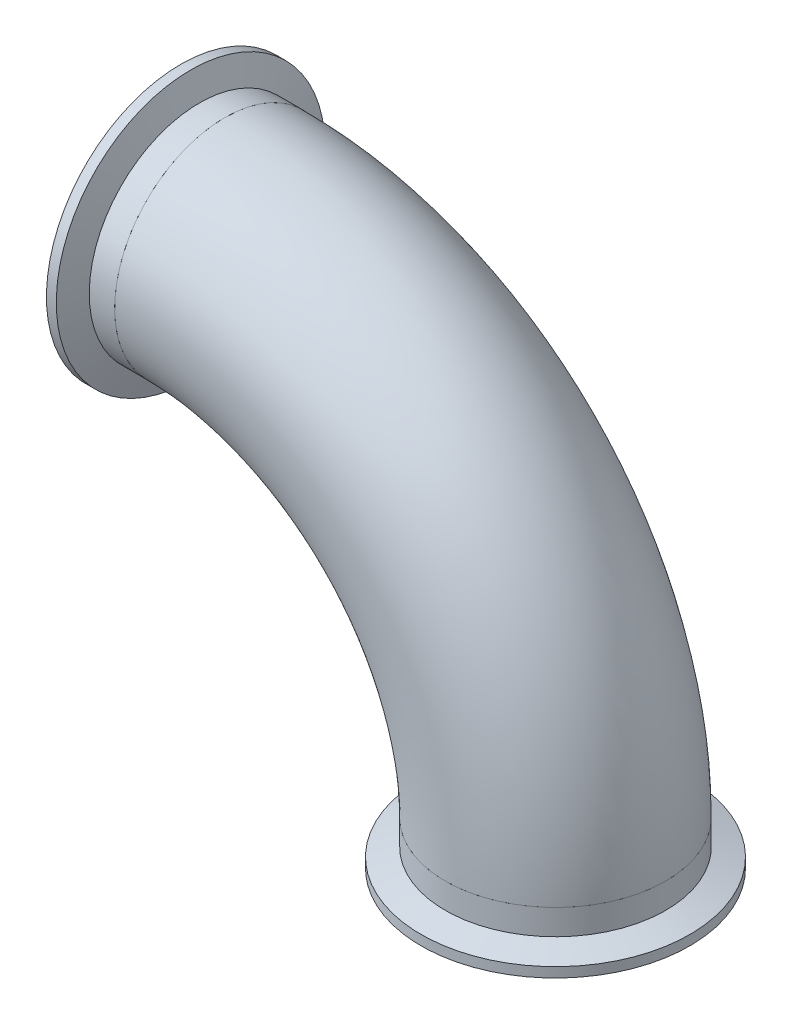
ISO-10303-21;
HEADER;
FILE_DESCRIPTION(('STEP AP214'),'2;1');
FILE_NAME('part.step','',(''),(''),'','','');
FILE_SCHEMA(('AUTOMOTIVE_DESIGN { 1 0 10303 214 1 1 1 1 }'));
ENDSEC;
DATA;
#1=APPLICATION_CONTEXT('core data for automotive mechanical design processes');
#2=APPLICATION_PROTOCOL_DEFINITION('international standard','automotive_design',2000,#1);
#3=PRODUCT_CONTEXT('',#1,'mechanical');
#4=PRODUCT('Part','Part','',(#3));
#5=PRODUCT_RELATED_PRODUCT_CATEGORY('part','',(#4));
#6=PRODUCT_DEFINITION_FORMATION('','',#4);
#7=PRODUCT_DEFINITION_CONTEXT('part definition',#1,'design');
#8=PRODUCT_DEFINITION('design','',#6,#7);
#9=PRODUCT_DEFINITION_SHAPE('','',#8);
#10=(LENGTH_UNIT() NAMED_UNIT(*) SI_UNIT(.MILLI.,.METRE.));
#11=(NAMED_UNIT(*) PLANE_ANGLE_UNIT() SI_UNIT($,.RADIAN.));
#12=(NAMED_UNIT(*) SI_UNIT($,.STERADIAN.) SOLID_ANGLE_UNIT());
#13=UNCERTAINTY_MEASURE_WITH_UNIT(LENGTH_MEASURE(1.E-05),#10,'distance_accuracy_value','');
#14=(GEOMETRIC_REPRESENTATION_CONTEXT(3) GLOBAL_UNCERTAINTY_ASSIGNED_CONTEXT((#13)) GLOBAL_UNIT_ASSIGNED_CONTEXT((#10,
#11,#12)) REPRESENTATION_CONTEXT('',''));
#15=CARTESIAN_POINT('',(0.,0.,0.));
#16=DIRECTION('',(0.,0.,1.));
#17=DIRECTION('',(1.,0.,0.));
#18=AXIS2_PLACEMENT_3D('',#15,#16,#17);
#19=CARTESIAN_POINT('',(29.6629173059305,39.0515919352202,125.341541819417));
#20=DIRECTION('',(0.,0.,-1.));
#21=DIRECTION('',(-1.,0.,0.));
#22=AXIS2_PLACEMENT_3D('',#19,#20,#21);
#23=TOROIDAL_SURFACE('',#22,95.25,31.75);
#24=CARTESIAN_POINT('',(29.6629173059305,134.30159193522,125.341541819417));
#25=DIRECTION('',(-1.,0.,0.));
#26=DIRECTION('',(0.,0.,1.));
#27=AXIS2_PLACEMENT_3D('',#24,#25,#26);
#28=CIRCLE('',#27,31.75);
#29=CARTESIAN_POINT('',(29.6629173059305,166.05159193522,125.341541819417));
#30=VERTEX_POINT('',#29);
#31=EDGE_CURVE('P0_E10',#30,#30,#28,.T.);
#32=CARTESIAN_POINT('',(124.91291730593,39.0515919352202,125.341541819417));
#33=DIRECTION('',(0.,1.,0.));
#34=DIRECTION('',(0.,0.,1.));
#35=AXIS2_PLACEMENT_3D('',#32,#33,#34);
#36=CIRCLE('',#35,31.75);
#37=CARTESIAN_POINT('',(156.66291730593,39.0515919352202,125.341541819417));
#38=VERTEX_POINT('',#37);
#39=EDGE_CURVE('P0_E21',#38,#38,#36,.T.);
#40=CARTESIAN_POINT('',(29.6629173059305,39.0515919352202,125.341541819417));
#41=DIRECTION('',(0.,0.,-1.));
#42=DIRECTION('',(-1.,0.,0.));
#43=AXIS2_PLACEMENT_3D('',#40,#41,#42);
#44=CIRCLE('',#43,127.);
#45=EDGE_CURVE('',#30,#38,#44,.T.);
#46=ORIENTED_EDGE('',*,*,#31,.F.);
#47=ORIENTED_EDGE('',*,*,#39,.T.);
#48=ORIENTED_EDGE('',*,*,#45,.T.);
#49=ORIENTED_EDGE('',*,*,#45,.F.);
#50=EDGE_LOOP('',(#46,#48,#47,#49));
#51=FACE_BOUND('',#50,.T.);
#52=ADVANCED_FACE('P0_F15',(#51),#23,.T.);
#53=CARTESIAN_POINT('',(29.6629173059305,134.30159193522,125.341541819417));
#54=DIRECTION('',(-1.,0.,0.));
#55=DIRECTION('',(0.,0.,1.));
#56=AXIS2_PLACEMENT_3D('',#53,#54,#55);
#57=PLANE('',#56);
#58=CARTESIAN_POINT('',(29.6629173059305,134.30159193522,125.341541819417));
#59=DIRECTION('',(-1.,0.,0.));
#60=DIRECTION('',(0.,-1.,0.));
#61=AXIS2_PLACEMENT_3D('',#58,#59,#60);
#62=CIRCLE('',#61,30.099);
#63=CARTESIAN_POINT('',(29.6629173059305,164.40059193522,125.341541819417));
#64=VERTEX_POINT('',#63);
#65=EDGE_CURVE('P0_E25',#64,#64,#62,.T.);
#66=ORIENTED_EDGE('',*,*,#65,.F.);
#67=EDGE_LOOP('',(#66));
#68=FACE_BOUND('',#67,.T.);
#69=ORIENTED_EDGE('',*,*,#31,.T.);
#70=EDGE_LOOP('',(#69));
#71=FACE_BOUND('',#70,.T.);
#72=ADVANCED_FACE('P0_F46',(#68,#71),#57,.T.);
#73=CARTESIAN_POINT('',(124.91291730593,39.0515919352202,125.341541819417));
#74=DIRECTION('',(0.,1.,0.));
#75=DIRECTION('',(0.,0.,1.));
#76=AXIS2_PLACEMENT_3D('',#73,#74,#75);
#77=PLANE('',#76);
#78=CARTESIAN_POINT('',(124.91291730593,39.0515919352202,125.341541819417));
#79=DIRECTION('',(0.,1.,0.));
#80=DIRECTION('',(0.,0.,1.));
#81=AXIS2_PLACEMENT_3D('',#78,#79,#80);
#82=CIRCLE('',#81,30.099);
#83=CARTESIAN_POINT('',(155.01191730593,39.0515919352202,125.341541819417));
#84=VERTEX_POINT('',#83);
#85=EDGE_CURVE('P0_E29',#84,#84,#82,.T.);
#86=ORIENTED_EDGE('',*,*,#85,.T.);
#87=EDGE_LOOP('',(#86));
#88=FACE_BOUND('',#87,.T.);
#89=ORIENTED_EDGE('',*,*,#39,.F.);
#90=EDGE_LOOP('',(#89));
#91=FACE_BOUND('',#90,.T.);
#92=ADVANCED_FACE('P0_F35',(#88,#91),#77,.F.);
#93=CARTESIAN_POINT('',(29.6629173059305,39.0515919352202,125.341541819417));
#94=DIRECTION('',(0.,0.,-1.));
#95=DIRECTION('',(-1.,0.,0.));
#96=AXIS2_PLACEMENT_3D('',#93,#94,#95);
#97=TOROIDAL_SURFACE('',#96,95.25,30.099);
#98=CARTESIAN_POINT('',(29.6629173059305,39.0515919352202,125.341541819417));
#99=DIRECTION('',(0.,0.,-1.));
#100=DIRECTION('',(-1.,0.,0.));
#101=AXIS2_PLACEMENT_3D('',#98,#99,#100);
#102=CIRCLE('',#101,125.349);
#103=EDGE_CURVE('',#64,#84,#102,.T.);
#104=ORIENTED_EDGE('',*,*,#65,.T.);
#105=ORIENTED_EDGE('',*,*,#85,.F.);
#106=ORIENTED_EDGE('',*,*,#103,.T.);
#107=ORIENTED_EDGE('',*,*,#103,.F.);
#108=EDGE_LOOP('',(#104,#106,#105,#107));
#109=FACE_BOUND('',#108,.T.);
#110=ADVANCED_FACE('P0_F38',(#109),#97,.F.);
#111=CLOSED_SHELL('',(#52,#72,#92,#110));
#112=MANIFOLD_SOLID_BREP('P0_B1',#111);
#113=CARTESIAN_POINT('',(17.7503173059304,134.30159193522,125.341541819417));
#114=DIRECTION('',(-1.00000000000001,0.,0.));
#115=DIRECTION('',(0.,0.772323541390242,-0.635229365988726));
#116=AXIS2_PLACEMENT_3D('',#113,#114,#115);
#117=TOROIDAL_SURFACE('',#116,37.1367084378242,0.787400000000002);
#118=CARTESIAN_POINT('',(16.9629173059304,134.30159193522,125.341541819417));
#119=DIRECTION('',(-1.00000000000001,0.,0.));
#120=DIRECTION('',(0.,0.772323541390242,-0.635229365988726));
#121=AXIS2_PLACEMENT_3D('',#118,#119,#120);
#122=CIRCLE('',#121,37.1367084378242);
#123=CARTESIAN_POINT('',(16.9629173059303,162.983146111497,101.75121406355));
#124=VERTEX_POINT('',#123);
#125=EDGE_CURVE('P1_E48',#124,#124,#122,.T.);
#126=ORIENTED_EDGE('',*,*,#125,.T.);
#127=EDGE_LOOP('',(#126));
#128=FACE_BOUND('',#127,.T.);
#129=CARTESIAN_POINT('',(17.4373762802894,134.30159193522,125.341541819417));
#130=DIRECTION('',(-1.00000000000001,0.,0.));
#131=DIRECTION('',(0.,0.772323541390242,-0.635229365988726));
#132=AXIS2_PLACEMENT_3D('',#129,#130,#131);
#133=CIRCLE('',#132,36.4141666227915);
#134=CARTESIAN_POINT('',(17.4373762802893,162.425110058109,102.210193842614));
#135=VERTEX_POINT('',#134);
#136=EDGE_CURVE('P1_E9',#135,#135,#133,.T.);
#137=ORIENTED_EDGE('',*,*,#136,.F.);
#138=EDGE_LOOP('',(#137));
#139=FACE_BOUND('',#138,.T.);
#140=ADVANCED_FACE('P1_F14',(#128,#139),#117,.T.);
#141=CARTESIAN_POINT('',(16.9629173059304,134.30159193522,125.341541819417));
#142=DIRECTION('',(-1.00000000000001,0.,0.));
#143=DIRECTION('',(0.,0.772323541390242,-0.635229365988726));
#144=AXIS2_PLACEMENT_3D('',#141,#142,#143);
#145=TOROIDAL_SURFACE('',#144,35.3187,1.1938);
#146=CARTESIAN_POINT('',(17.4373762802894,134.30159193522,125.341541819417));
#147=DIRECTION('',(-1.00000000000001,0.,0.));
#148=DIRECTION('',(0.,0.772323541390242,-0.635229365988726));
#149=AXIS2_PLACEMENT_3D('',#146,#147,#148);
#150=CIRCLE('',#149,34.2232333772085);
#151=CARTESIAN_POINT('',(17.4373762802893,160.733000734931,103.601938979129));
#152=VERTEX_POINT('',#151);
#153=EDGE_CURVE('P1_E20',#152,#152,#150,.T.);
#154=ORIENTED_EDGE('',*,*,#153,.F.);
#155=EDGE_LOOP('',(#154));
#156=FACE_BOUND('',#155,.T.);
#157=ORIENTED_EDGE('',*,*,#136,.T.);
#158=EDGE_LOOP('',(#157));
#159=FACE_BOUND('',#158,.T.);
#160=ADVANCED_FACE('P1_F97',(#156,#159),#145,.F.);
#161=CARTESIAN_POINT('',(17.7503173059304,134.30159193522,125.341541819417));
#162=DIRECTION('',(-1.00000000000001,0.,0.));
#163=DIRECTION('',(0.,0.772323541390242,-0.635229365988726));
#164=AXIS2_PLACEMENT_3D('',#161,#162,#163);
#165=TOROIDAL_SURFACE('',#164,33.5006915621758,0.787399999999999);
#166=ORIENTED_EDGE('',*,*,#153,.T.);
#167=EDGE_LOOP('',(#166));
#168=FACE_BOUND('',#167,.T.);
#169=CARTESIAN_POINT('',(16.9629173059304,134.30159193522,125.341541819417));
#170=DIRECTION('',(-1.00000000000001,0.,0.));
#171=DIRECTION('',(0.,0.772323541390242,-0.635229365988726));
#172=AXIS2_PLACEMENT_3D('',#169,#170,#171);
#173=CIRCLE('',#172,33.5006915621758);
#174=CARTESIAN_POINT('',(16.9629173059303,160.174964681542,104.060918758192));
#175=VERTEX_POINT('',#174);
#176=EDGE_CURVE('P1_E24',#175,#175,#173,.T.);
#177=ORIENTED_EDGE('',*,*,#176,.F.);
#178=EDGE_LOOP('',(#177));
#179=FACE_BOUND('',#178,.T.);
#180=ADVANCED_FACE('P1_F93',(#168,#179),#165,.T.);
#181=CARTESIAN_POINT('',(16.9629173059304,134.30159193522,125.341541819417));
#182=DIRECTION('',(1.00000000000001,0.,0.));
#183=DIRECTION('',(0.,-0.772323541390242,0.635229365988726));
#184=AXIS2_PLACEMENT_3D('',#181,#182,#183);
#185=PLANE('',#184);
#186=CARTESIAN_POINT('',(16.9629173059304,134.30159193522,125.341541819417));
#187=DIRECTION('',(-1.00000000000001,0.,0.));
#188=DIRECTION('',(0.,0.772323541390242,-0.635229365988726));
#189=AXIS2_PLACEMENT_3D('',#186,#187,#188);
#190=CIRCLE('',#189,30.099);
#191=CARTESIAN_POINT('',(16.9629173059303,157.547758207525,106.221773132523));
#192=VERTEX_POINT('',#191);
#193=EDGE_CURVE('P1_E28',#192,#192,#190,.T.);
#194=ORIENTED_EDGE('',*,*,#193,.F.);
#195=EDGE_LOOP('',(#194));
#196=FACE_BOUND('',#195,.T.);
#197=ORIENTED_EDGE('',*,*,#176,.T.);
#198=EDGE_LOOP('',(#197));
#199=FACE_BOUND('',#198,.T.);
#200=ADVANCED_FACE('P1_F86',(#196,#199),#185,.F.);
#201=CARTESIAN_POINT('',(16.9629173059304,134.30159193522,125.341541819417));
#202=DIRECTION('',(-1.00000000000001,0.,0.));
#203=DIRECTION('',(0.,0.772323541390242,-0.635229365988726));
#204=AXIS2_PLACEMENT_3D('',#201,#202,#203);
#205=CYLINDRICAL_SURFACE('',#204,30.099);
#206=ORIENTED_EDGE('',*,*,#193,.T.);
#207=EDGE_LOOP('',(#206));
#208=FACE_BOUND('',#207,.T.);
#209=CARTESIAN_POINT('',(29.6629173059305,134.30159193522,125.341541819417));
#210=DIRECTION('',(-1.00000000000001,0.,0.));
#211=DIRECTION('',(0.,0.772323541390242,-0.635229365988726));
#212=AXIS2_PLACEMENT_3D('',#209,#210,#211);
#213=CIRCLE('',#212,30.099);
#214=CARTESIAN_POINT('',(29.6629173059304,157.547758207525,106.221773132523));
#215=VERTEX_POINT('',#214);
#216=EDGE_CURVE('P1_E33',#215,#215,#213,.T.);
#217=ORIENTED_EDGE('',*,*,#216,.F.);
#218=EDGE_LOOP('',(#217));
#219=FACE_BOUND('',#218,.T.);
#220=ADVANCED_FACE('P1_F81',(#208,#219),#205,.F.);
#221=CARTESIAN_POINT('',(29.6629173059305,134.30159193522,125.341541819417));
#222=DIRECTION('',(-1.00000000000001,0.,0.));
#223=DIRECTION('',(0.,0.772323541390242,-0.635229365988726));
#224=AXIS2_PLACEMENT_3D('',#221,#222,#223);
#225=PLANE('',#224);
#226=CARTESIAN_POINT('',(29.6629173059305,134.30159193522,125.341541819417));
#227=DIRECTION('',(-1.00000000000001,0.,0.));
#228=DIRECTION('',(0.,0.772323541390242,-0.635229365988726));
#229=AXIS2_PLACEMENT_3D('',#226,#227,#228);
#230=CIRCLE('',#229,31.75);
#231=CARTESIAN_POINT('',(29.6629173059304,158.82286437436,105.173009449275));
#232=VERTEX_POINT('',#231);
#233=EDGE_CURVE('P1_E36',#232,#232,#230,.T.);
#234=ORIENTED_EDGE('',*,*,#233,.F.);
#235=EDGE_LOOP('',(#234));
#236=FACE_BOUND('',#235,.T.);
#237=ORIENTED_EDGE('',*,*,#216,.T.);
#238=EDGE_LOOP('',(#237));
#239=FACE_BOUND('',#238,.T.);
#240=ADVANCED_FACE('P1_F75',(#236,#239),#225,.F.);
#241=CARTESIAN_POINT('',(16.9629173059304,134.30159193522,125.341541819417));
#242=DIRECTION('',(-1.00000000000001,0.,0.));
#243=DIRECTION('',(0.,0.772323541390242,-0.635229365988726));
#244=AXIS2_PLACEMENT_3D('',#241,#242,#243);
#245=CYLINDRICAL_SURFACE('',#244,31.75);
#246=CARTESIAN_POINT('',(22.3408045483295,134.30159193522,125.341541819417));
#247=DIRECTION('',(-1.00000000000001,0.,0.));
#248=DIRECTION('',(0.,0.772323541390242,-0.635229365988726));
#249=AXIS2_PLACEMENT_3D('',#246,#247,#248);
#250=CIRCLE('',#249,31.75);
#251=CARTESIAN_POINT('',(22.3408045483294,158.822864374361,105.173009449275));
#252=VERTEX_POINT('',#251);
#253=EDGE_CURVE('P1_E39',#252,#252,#250,.T.);
#254=ORIENTED_EDGE('',*,*,#253,.F.);
#255=EDGE_LOOP('',(#254));
#256=FACE_BOUND('',#255,.T.);
#257=ORIENTED_EDGE('',*,*,#233,.T.);
#258=EDGE_LOOP('',(#257));
#259=FACE_BOUND('',#258,.T.);
#260=ADVANCED_FACE('P1_F69',(#256,#259),#245,.T.);
#261=CARTESIAN_POINT('',(22.3408045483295,134.30159193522,125.341541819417));
#262=DIRECTION('',(-1.00000000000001,0.,0.));
#263=DIRECTION('',(0.,0.772323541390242,-0.635229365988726));
#264=AXIS2_PLACEMENT_3D('',#261,#262,#263);
#265=CONICAL_SURFACE('',#264,31.75,1.22173047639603);
#266=CARTESIAN_POINT('',(19.8077173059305,134.30159193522,125.341541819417));
#267=DIRECTION('',(-1.00000000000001,0.,0.));
#268=DIRECTION('',(0.,0.772323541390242,-0.635229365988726));
#269=AXIS2_PLACEMENT_3D('',#266,#267,#268);
#270=CIRCLE('',#269,38.7096);
#271=CARTESIAN_POINT('',(19.8077173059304,164.19792729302,100.75206715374));
#272=VERTEX_POINT('',#271);
#273=EDGE_CURVE('P1_E42',#272,#272,#270,.T.);
#274=ORIENTED_EDGE('',*,*,#273,.F.);
#275=EDGE_LOOP('',(#274));
#276=FACE_BOUND('',#275,.T.);
#277=ORIENTED_EDGE('',*,*,#253,.T.);
#278=EDGE_LOOP('',(#277));
#279=FACE_BOUND('',#278,.T.);
#280=ADVANCED_FACE('P1_F63',(#276,#279),#265,.T.);
#281=CARTESIAN_POINT('',(16.9629173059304,134.30159193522,125.341541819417));
#282=DIRECTION('',(-1.00000000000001,0.,0.));
#283=DIRECTION('',(0.,0.772323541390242,-0.635229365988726));
#284=AXIS2_PLACEMENT_3D('',#281,#282,#283);
#285=CYLINDRICAL_SURFACE('',#284,38.7096);
#286=CARTESIAN_POINT('',(16.9629173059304,134.30159193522,125.341541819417));
#287=DIRECTION('',(-1.00000000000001,0.,0.));
#288=DIRECTION('',(0.,0.772323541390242,-0.635229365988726));
#289=AXIS2_PLACEMENT_3D('',#286,#287,#288);
#290=CIRCLE('',#289,38.7096);
#291=CARTESIAN_POINT('',(16.9629173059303,164.19792729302,100.75206715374));
#292=VERTEX_POINT('',#291);
#293=EDGE_CURVE('P1_E45',#292,#292,#290,.T.);
#294=ORIENTED_EDGE('',*,*,#293,.F.);
#295=EDGE_LOOP('',(#294));
#296=FACE_BOUND('',#295,.T.);
#297=ORIENTED_EDGE('',*,*,#273,.T.);
#298=EDGE_LOOP('',(#297));
#299=FACE_BOUND('',#298,.T.);
#300=ADVANCED_FACE('P1_F57',(#296,#299),#285,.T.);
#301=CARTESIAN_POINT('',(16.9629173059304,134.30159193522,125.341541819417));
#302=DIRECTION('',(1.00000000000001,0.,0.));
#303=DIRECTION('',(0.,-0.772323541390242,0.635229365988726));
#304=AXIS2_PLACEMENT_3D('',#301,#302,#303);
#305=PLANE('',#304);
#306=ORIENTED_EDGE('',*,*,#125,.F.);
#307=EDGE_LOOP('',(#306));
#308=FACE_BOUND('',#307,.T.);
#309=ORIENTED_EDGE('',*,*,#293,.T.);
#310=EDGE_LOOP('',(#309));
#311=FACE_BOUND('',#310,.T.);
#312=ADVANCED_FACE('P1_F54',(#308,#311),#305,.F.);
#313=CLOSED_SHELL('',(#140,#160,#180,#200,#220,#240,#260,#280,#300,#312));
#314=MANIFOLD_SOLID_BREP('P1_B1',#313);
#315=CARTESIAN_POINT('',(124.91291730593,27.1389919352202,125.341541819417));
#316=DIRECTION('',(0.,-1.00000000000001,0.));
#317=DIRECTION('',(0.,0.,-1.));
#318=AXIS2_PLACEMENT_3D('',#315,#316,#317);
#319=TOROIDAL_SURFACE('',#318,37.1367084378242,0.787400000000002);
#320=CARTESIAN_POINT('',(124.912917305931,26.3515919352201,125.341541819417));
#321=DIRECTION('',(0.,-1.00000000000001,0.));
#322=DIRECTION('',(0.,0.,-1.));
#323=AXIS2_PLACEMENT_3D('',#320,#321,#322);
#324=CIRCLE('',#323,37.1367084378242);
#325=CARTESIAN_POINT('',(124.912917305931,26.3515919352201,88.204833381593));
#326=VERTEX_POINT('',#325);
#327=EDGE_CURVE('P2_E49',#326,#326,#324,.T.);
#328=ORIENTED_EDGE('',*,*,#327,.T.);
#329=EDGE_LOOP('',(#328));
#330=FACE_BOUND('',#329,.T.);
#331=CARTESIAN_POINT('',(124.91291730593,26.8260509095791,125.341541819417));
#332=DIRECTION('',(0.,-1.00000000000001,0.));
#333=DIRECTION('',(0.,0.,-1.));
#334=AXIS2_PLACEMENT_3D('',#331,#332,#333);
#335=CIRCLE('',#334,36.4141666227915);
#336=CARTESIAN_POINT('',(124.91291730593,26.8260509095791,88.9273751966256));
#337=VERTEX_POINT('',#336);
#338=EDGE_CURVE('P2_E10',#337,#337,#335,.T.);
#339=ORIENTED_EDGE('',*,*,#338,.F.);
#340=EDGE_LOOP('',(#339));
#341=FACE_BOUND('',#340,.T.);
#342=ADVANCED_FACE('P2_F15',(#330,#341),#319,.T.);
#343=CARTESIAN_POINT('',(124.912917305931,26.3515919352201,125.341541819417));
#344=DIRECTION('',(0.,-1.00000000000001,0.));
#345=DIRECTION('',(0.,0.,-1.));
#346=AXIS2_PLACEMENT_3D('',#343,#344,#345);
#347=TOROIDAL_SURFACE('',#346,35.3187,1.1938);
#348=CARTESIAN_POINT('',(124.91291730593,26.8260509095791,125.341541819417));
#349=DIRECTION('',(0.,-1.00000000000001,0.));
#350=DIRECTION('',(0.,0.,-1.));
#351=AXIS2_PLACEMENT_3D('',#348,#349,#350);
#352=CIRCLE('',#351,34.2232333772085);
#353=CARTESIAN_POINT('',(124.91291730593,26.8260509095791,91.1183084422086));
#354=VERTEX_POINT('',#353);
#355=EDGE_CURVE('P2_E21',#354,#354,#352,.T.);
#356=ORIENTED_EDGE('',*,*,#355,.F.);
#357=EDGE_LOOP('',(#356));
#358=FACE_BOUND('',#357,.T.);
#359=ORIENTED_EDGE('',*,*,#338,.T.);
#360=EDGE_LOOP('',(#359));
#361=FACE_BOUND('',#360,.T.);
#362=ADVANCED_FACE('P2_F98',(#358,#361),#347,.F.);
#363=CARTESIAN_POINT('',(124.91291730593,27.1389919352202,125.341541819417));
#364=DIRECTION('',(0.,-1.00000000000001,0.));
#365=DIRECTION('',(0.,0.,-1.));
#366=AXIS2_PLACEMENT_3D('',#363,#364,#365);
#367=TOROIDAL_SURFACE('',#366,33.5006915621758,0.787399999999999);
#368=ORIENTED_EDGE('',*,*,#355,.T.);
#369=EDGE_LOOP('',(#368));
#370=FACE_BOUND('',#369,.T.);
#371=CARTESIAN_POINT('',(124.912917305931,26.3515919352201,125.341541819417));
#372=DIRECTION('',(0.,-1.00000000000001,0.));
#373=DIRECTION('',(0.,0.,-1.));
#374=AXIS2_PLACEMENT_3D('',#371,#372,#373);
#375=CIRCLE('',#374,33.5006915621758);
#376=CARTESIAN_POINT('',(124.912917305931,26.3515919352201,91.8408502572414));
#377=VERTEX_POINT('',#376);
#378=EDGE_CURVE('P2_E25',#377,#377,#375,.T.);
#379=ORIENTED_EDGE('',*,*,#378,.F.);
#380=EDGE_LOOP('',(#379));
#381=FACE_BOUND('',#380,.T.);
#382=ADVANCED_FACE('P2_F94',(#370,#381),#367,.T.);
#383=CARTESIAN_POINT('',(124.912917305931,26.3515919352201,125.341541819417));
#384=DIRECTION('',(0.,1.00000000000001,0.));
#385=DIRECTION('',(0.,0.,1.));
#386=AXIS2_PLACEMENT_3D('',#383,#384,#385);
#387=PLANE('',#386);
#388=CARTESIAN_POINT('',(124.912917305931,26.3515919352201,125.341541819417));
#389=DIRECTION('',(0.,-1.00000000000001,0.));
#390=DIRECTION('',(0.,0.,-1.));
#391=AXIS2_PLACEMENT_3D('',#388,#389,#390);
#392=CIRCLE('',#391,30.099);
#393=CARTESIAN_POINT('',(124.912917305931,26.3515919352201,95.2425418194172));
#394=VERTEX_POINT('',#393);
#395=EDGE_CURVE('P2_E29',#394,#394,#392,.T.);
#396=ORIENTED_EDGE('',*,*,#395,.F.);
#397=EDGE_LOOP('',(#396));
#398=FACE_BOUND('',#397,.T.);
#399=ORIENTED_EDGE('',*,*,#378,.T.);
#400=EDGE_LOOP('',(#399));
#401=FACE_BOUND('',#400,.T.);
#402=ADVANCED_FACE('P2_F87',(#398,#401),#387,.F.);
#403=CARTESIAN_POINT('',(124.912917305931,26.3515919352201,125.341541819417));
#404=DIRECTION('',(0.,-1.00000000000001,0.));
#405=DIRECTION('',(0.,0.,-1.));
#406=AXIS2_PLACEMENT_3D('',#403,#404,#405);
#407=CYLINDRICAL_SURFACE('',#406,30.099);
#408=ORIENTED_EDGE('',*,*,#395,.T.);
#409=EDGE_LOOP('',(#408));
#410=FACE_BOUND('',#409,.T.);
#411=CARTESIAN_POINT('',(124.912917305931,39.0515919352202,125.341541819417));
#412=DIRECTION('',(0.,-1.00000000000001,0.));
#413=DIRECTION('',(0.,0.,-1.));
#414=AXIS2_PLACEMENT_3D('',#411,#412,#413);
#415=CIRCLE('',#414,30.099);
#416=CARTESIAN_POINT('',(124.91291730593,39.0515919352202,95.2425418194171));
#417=VERTEX_POINT('',#416);
#418=EDGE_CURVE('P2_E34',#417,#417,#415,.T.);
#419=ORIENTED_EDGE('',*,*,#418,.F.);
#420=EDGE_LOOP('',(#419));
#421=FACE_BOUND('',#420,.T.);
#422=ADVANCED_FACE('P2_F82',(#410,#421),#407,.F.);
#423=CARTESIAN_POINT('',(124.912917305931,39.0515919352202,125.341541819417));
#424=DIRECTION('',(0.,-1.00000000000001,0.));
#425=DIRECTION('',(0.,0.,-1.));
#426=AXIS2_PLACEMENT_3D('',#423,#424,#425);
#427=PLANE('',#426);
#428=CARTESIAN_POINT('',(124.912917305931,39.0515919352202,125.341541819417));
#429=DIRECTION('',(0.,-1.00000000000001,0.));
#430=DIRECTION('',(0.,0.,-1.));
#431=AXIS2_PLACEMENT_3D('',#428,#429,#430);
#432=CIRCLE('',#431,31.75);
#433=CARTESIAN_POINT('',(124.91291730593,39.0515919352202,93.5915418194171));
#434=VERTEX_POINT('',#433);
#435=EDGE_CURVE('P2_E37',#434,#434,#432,.T.);
#436=ORIENTED_EDGE('',*,*,#435,.F.);
#437=EDGE_LOOP('',(#436));
#438=FACE_BOUND('',#437,.T.);
#439=ORIENTED_EDGE('',*,*,#418,.T.);
#440=EDGE_LOOP('',(#439));
#441=FACE_BOUND('',#440,.T.);
#442=ADVANCED_FACE('P2_F76',(#438,#441),#427,.F.);
#443=CARTESIAN_POINT('',(124.912917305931,26.3515919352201,125.341541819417));
#444=DIRECTION('',(0.,-1.00000000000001,0.));
#445=DIRECTION('',(0.,0.,-1.));
#446=AXIS2_PLACEMENT_3D('',#443,#444,#445);
#447=CYLINDRICAL_SURFACE('',#446,31.75);
#448=CARTESIAN_POINT('',(124.912917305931,31.7294791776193,125.341541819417));
#449=DIRECTION('',(0.,-1.00000000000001,0.));
#450=DIRECTION('',(0.,0.,-1.));
#451=AXIS2_PLACEMENT_3D('',#448,#449,#450);
#452=CIRCLE('',#451,31.75);
#453=CARTESIAN_POINT('',(124.91291730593,31.7294791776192,93.591541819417));
#454=VERTEX_POINT('',#453);
#455=EDGE_CURVE('P2_E40',#454,#454,#452,.T.);
#456=ORIENTED_EDGE('',*,*,#455,.F.);
#457=EDGE_LOOP('',(#456));
#458=FACE_BOUND('',#457,.T.);
#459=ORIENTED_EDGE('',*,*,#435,.T.);
#460=EDGE_LOOP('',(#459));
#461=FACE_BOUND('',#460,.T.);
#462=ADVANCED_FACE('P2_F70',(#458,#461),#447,.T.);
#463=CARTESIAN_POINT('',(124.912917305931,31.7294791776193,125.341541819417));
#464=DIRECTION('',(0.,-1.00000000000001,0.));
#465=DIRECTION('',(0.,0.,-1.));
#466=AXIS2_PLACEMENT_3D('',#463,#464,#465);
#467=CONICAL_SURFACE('',#466,31.75,1.22173047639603);
#468=CARTESIAN_POINT('',(124.912917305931,29.1963919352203,125.341541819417));
#469=DIRECTION('',(0.,-1.00000000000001,0.));
#470=DIRECTION('',(0.,0.,-1.));
#471=AXIS2_PLACEMENT_3D('',#468,#469,#470);
#472=CIRCLE('',#471,38.7096);
#473=CARTESIAN_POINT('',(124.91291730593,29.1963919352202,86.6319418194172));
#474=VERTEX_POINT('',#473);
#475=EDGE_CURVE('P2_E43',#474,#474,#472,.T.);
#476=ORIENTED_EDGE('',*,*,#475,.F.);
#477=EDGE_LOOP('',(#476));
#478=FACE_BOUND('',#477,.T.);
#479=ORIENTED_EDGE('',*,*,#455,.T.);
#480=EDGE_LOOP('',(#479));
#481=FACE_BOUND('',#480,.T.);
#482=ADVANCED_FACE('P2_F64',(#478,#481),#467,.T.);
#483=CARTESIAN_POINT('',(124.912917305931,26.3515919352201,125.341541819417));
#484=DIRECTION('',(0.,-1.00000000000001,0.));
#485=DIRECTION('',(0.,0.,-1.));
#486=AXIS2_PLACEMENT_3D('',#483,#484,#485);
#487=CYLINDRICAL_SURFACE('',#486,38.7096);
#488=CARTESIAN_POINT('',(124.912917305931,26.3515919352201,125.341541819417));
#489=DIRECTION('',(0.,-1.00000000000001,0.));
#490=DIRECTION('',(0.,0.,-1.));
#491=AXIS2_PLACEMENT_3D('',#488,#489,#490);
#492=CIRCLE('',#491,38.7096);
#493=CARTESIAN_POINT('',(124.912917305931,26.3515919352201,86.6319418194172));
#494=VERTEX_POINT('',#493);
#495=EDGE_CURVE('P2_E46',#494,#494,#492,.T.);
#496=ORIENTED_EDGE('',*,*,#495,.F.);
#497=EDGE_LOOP('',(#496));
#498=FACE_BOUND('',#497,.T.);
#499=ORIENTED_EDGE('',*,*,#475,.T.);
#500=EDGE_LOOP('',(#499));
#501=FACE_BOUND('',#500,.T.);
#502=ADVANCED_FACE('P2_F58',(#498,#501),#487,.T.);
#503=CARTESIAN_POINT('',(124.912917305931,26.3515919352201,125.341541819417));
#504=DIRECTION('',(0.,1.00000000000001,0.));
#505=DIRECTION('',(0.,0.,1.));
#506=AXIS2_PLACEMENT_3D('',#503,#504,#505);
#507=PLANE('',#506);
#508=ORIENTED_EDGE('',*,*,#327,.F.);
#509=EDGE_LOOP('',(#508));
#510=FACE_BOUND('',#509,.T.);
#511=ORIENTED_EDGE('',*,*,#495,.T.);
#512=EDGE_LOOP('',(#511));
#513=FACE_BOUND('',#512,.T.);
#514=ADVANCED_FACE('P2_F55',(#510,#513),#507,.F.);
#515=CLOSED_SHELL('',(#342,#362,#382,#402,#422,#442,#462,#482,#502,#514));
#516=MANIFOLD_SOLID_BREP('P2_B1',#515);
#517=ADVANCED_BREP_SHAPE_REPRESENTATION('',(#18,#112,#314,#516),#14);
#518=SHAPE_DEFINITION_REPRESENTATION(#9,#517);
ENDSEC;
END-ISO-10303-21;
